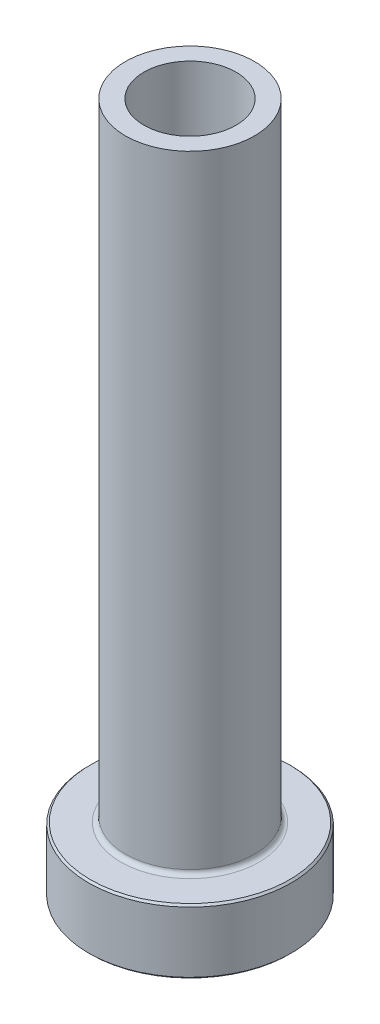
from build123d import *

# Parameters (mm, degrees)
FILLET1_R     = 0.5
CHAMFER1_SIZE = 0.2
CHAMFER3_SIZE = 0.5


with BuildPart() as part:
    # Sketch1 → Revolve1 (revolve)
    with BuildSketch(Plane.XY, mode=Mode.PRIVATE) as revolve1_sk:
        Polygon((-5, 75), (-7, 75), (-7, 7), (-11, 7), (-11, 0), (-5.25, 0), (-5.25, 18), (-5, 30), align=None)
    revolve(revolve1_sk.sketch.rotate(Axis((0, 92.187680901, 0), (0, -1, 0)), 270), axis=Axis((0, 92.187680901, 0), (0, -1, 0)))

    # Fillet1
    fillet1_edges = [part.edges().sort_by_distance(p)[0] for p in [
        (0, 7, -7),
    ]]
    fillet(fillet1_edges, radius=FILLET1_R)

    # Chamfer1
    chamfer1_edges = [part.edges().sort_by_distance(p)[0] for p in [
        (0, 0, -11),
        (0, 7, -11),
    ]]
    chamfer(chamfer1_edges, length=CHAMFER1_SIZE)

    # Chamfer3
    chamfer3_edges = [part.edges().sort_by_distance(p)[0] for p in [
        (0, 0, -5.25),
    ]]
    chamfer(chamfer3_edges, length=CHAMFER3_SIZE)


solid = part.part
